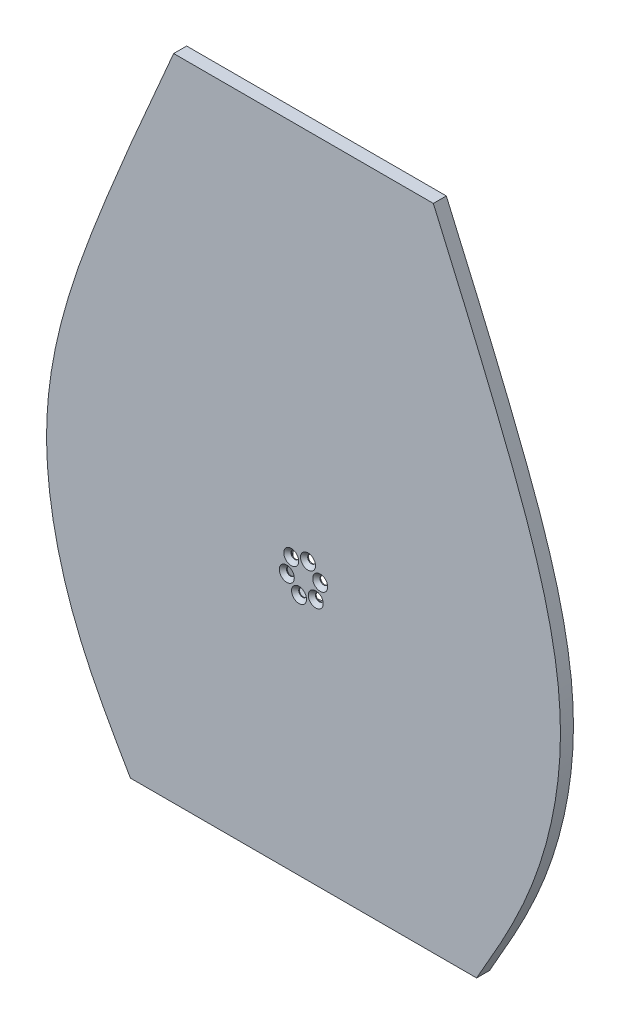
ISO-10303-21;
HEADER;
FILE_DESCRIPTION(('STEP AP214'),'2;1');
FILE_NAME('part.step','',(''),(''),'','','');
FILE_SCHEMA(('AUTOMOTIVE_DESIGN { 1 0 10303 214 1 1 1 1 }'));
ENDSEC;
DATA;
#1=APPLICATION_CONTEXT('core data for automotive mechanical design processes');
#2=APPLICATION_PROTOCOL_DEFINITION('international standard','automotive_design',2000,#1);
#3=PRODUCT_CONTEXT('',#1,'mechanical');
#4=PRODUCT('Part','Part','',(#3));
#5=PRODUCT_RELATED_PRODUCT_CATEGORY('part','',(#4));
#6=PRODUCT_DEFINITION_FORMATION('','',#4);
#7=PRODUCT_DEFINITION_CONTEXT('part definition',#1,'design');
#8=PRODUCT_DEFINITION('design','',#6,#7);
#9=PRODUCT_DEFINITION_SHAPE('','',#8);
#10=(LENGTH_UNIT() NAMED_UNIT(*) SI_UNIT(.MILLI.,.METRE.));
#11=(NAMED_UNIT(*) PLANE_ANGLE_UNIT() SI_UNIT($,.RADIAN.));
#12=(NAMED_UNIT(*) SI_UNIT($,.STERADIAN.) SOLID_ANGLE_UNIT());
#13=UNCERTAINTY_MEASURE_WITH_UNIT(LENGTH_MEASURE(1.E-05),#10,'distance_accuracy_value','');
#14=(GEOMETRIC_REPRESENTATION_CONTEXT(3) GLOBAL_UNCERTAINTY_ASSIGNED_CONTEXT((#13)) GLOBAL_UNIT_ASSIGNED_CONTEXT((#10,
#11,#12)) REPRESENTATION_CONTEXT('',''));
#15=CARTESIAN_POINT('',(0.,0.,0.));
#16=DIRECTION('',(0.,0.,1.));
#17=DIRECTION('',(1.,0.,0.));
#18=AXIS2_PLACEMENT_3D('',#15,#16,#17);
#19=CARTESIAN_POINT('',(200.,-300.,15.));
#20=CARTESIAN_POINT('',(220.438440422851,-264.664756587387,15.));
#21=CARTESIAN_POINT('',(273.637563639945,-172.69081291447,15.));
#22=CARTESIAN_POINT('',(317.637202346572,22.7615322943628,15.));
#23=CARTESIAN_POINT('',(241.360028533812,240.082695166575,15.));
#24=CARTESIAN_POINT('',(178.61116960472,384.260313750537,15.));
#25=CARTESIAN_POINT('',(150.,450.,15.));
#26=B_SPLINE_CURVE_WITH_KNOTS('',3,(#19,#20,#21,#22,#23,#24,#25),.UNSPECIFIED.,.F.,.F.,(4,1,1,1,
4),(0.,0.154462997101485,0.402051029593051,0.727357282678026,1.),.UNSPECIFIED.);
#27=DIRECTION('',(0.,0.,-1.));
#28=VECTOR('',#27,1.);
#29=SURFACE_OF_LINEAR_EXTRUSION('',#26,#28);
#30=CARTESIAN_POINT('',(200.,-300.,0.));
#31=CARTESIAN_POINT('',(220.438440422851,-264.664756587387,0.));
#32=CARTESIAN_POINT('',(273.637563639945,-172.69081291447,0.));
#33=CARTESIAN_POINT('',(317.637202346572,22.7615322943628,0.));
#34=CARTESIAN_POINT('',(241.360028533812,240.082695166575,0.));
#35=CARTESIAN_POINT('',(178.61116960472,384.260313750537,0.));
#36=CARTESIAN_POINT('',(150.,450.,0.));
#37=B_SPLINE_CURVE_WITH_KNOTS('',3,(#30,#31,#32,#33,#34,#35,#36),.UNSPECIFIED.,.F.,.F.,(4,1,1,1,
4),(0.,0.154462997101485,0.402051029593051,0.727357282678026,1.),.UNSPECIFIED.);
#38=CARTESIAN_POINT('',(200.,-300.,0.));
#39=VERTEX_POINT('',#38);
#40=CARTESIAN_POINT('',(150.,450.,0.));
#41=VERTEX_POINT('',#40);
#42=EDGE_CURVE('E79',#39,#41,#37,.T.);
#43=ORIENTED_EDGE('',*,*,#42,.T.);
#44=DIRECTION('',(0.,0.,-1.));
#45=VECTOR('',#44,1.);
#46=CARTESIAN_POINT('',(150.,450.,15.));
#47=LINE('',#46,#45);
#48=CARTESIAN_POINT('',(150.,450.,15.));
#49=VERTEX_POINT('',#48);
#50=EDGE_CURVE('E11',#49,#41,#47,.T.);
#51=ORIENTED_EDGE('',*,*,#50,.F.);
#52=CARTESIAN_POINT('',(200.,-300.,15.));
#53=VERTEX_POINT('',#52);
#54=EDGE_CURVE('E111',#53,#49,#26,.T.);
#55=ORIENTED_EDGE('',*,*,#54,.F.);
#56=DIRECTION('',(0.,0.,-1.));
#57=VECTOR('',#56,1.);
#58=CARTESIAN_POINT('',(200.,-300.,15.));
#59=LINE('',#58,#57);
#60=EDGE_CURVE('E91',#53,#39,#59,.T.);
#61=ORIENTED_EDGE('',*,*,#60,.T.);
#62=EDGE_LOOP('',(#43,#51,#55,#61));
#63=FACE_BOUND('',#62,.T.);
#64=ADVANCED_FACE('F32',(#63),#29,.F.);
#65=CARTESIAN_POINT('',(-150.,450.,15.));
#66=DIRECTION('',(0.,-1.,0.));
#67=DIRECTION('',(1.,0.,0.));
#68=AXIS2_PLACEMENT_3D('',#65,#66,#67);
#69=PLANE('',#68);
#70=DIRECTION('',(-1.,0.,0.));
#71=VECTOR('',#70,1.);
#72=CARTESIAN_POINT('',(-150.,450.,0.));
#73=LINE('',#72,#71);
#74=CARTESIAN_POINT('',(-150.,450.,0.));
#75=VERTEX_POINT('',#74);
#76=EDGE_CURVE('E75',#41,#75,#73,.T.);
#77=ORIENTED_EDGE('',*,*,#76,.T.);
#78=DIRECTION('',(0.,0.,-1.));
#79=VECTOR('',#78,1.);
#80=CARTESIAN_POINT('',(-150.,450.,15.));
#81=LINE('',#80,#79);
#82=CARTESIAN_POINT('',(-150.,450.,15.));
#83=VERTEX_POINT('',#82);
#84=EDGE_CURVE('E41',#83,#75,#81,.T.);
#85=ORIENTED_EDGE('',*,*,#84,.F.);
#86=DIRECTION('',(-1.,0.,0.));
#87=VECTOR('',#86,1.);
#88=CARTESIAN_POINT('',(-150.,450.,15.));
#89=LINE('',#88,#87);
#90=EDGE_CURVE('E87',#49,#83,#89,.T.);
#91=ORIENTED_EDGE('',*,*,#90,.F.);
#92=ORIENTED_EDGE('',*,*,#50,.T.);
#93=EDGE_LOOP('',(#77,#85,#91,#92));
#94=FACE_BOUND('',#93,.T.);
#95=ADVANCED_FACE('F86',(#94),#69,.F.);
#96=CARTESIAN_POINT('',(-150.,450.,15.));
#97=CARTESIAN_POINT('',(-178.61116960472,384.260313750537,15.));
#98=CARTESIAN_POINT('',(-241.360028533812,240.082695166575,15.));
#99=CARTESIAN_POINT('',(-317.637202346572,22.7615322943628,15.));
#100=CARTESIAN_POINT('',(-273.637563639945,-172.69081291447,15.));
#101=CARTESIAN_POINT('',(-220.438440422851,-264.664756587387,15.));
#102=CARTESIAN_POINT('',(-200.,-300.,15.));
#103=B_SPLINE_CURVE_WITH_KNOTS('',3,(#96,#97,#98,#99,#100,#101,#102),.UNSPECIFIED.,.F.,.F.,(4,1,
1,1,4),(0.,0.272642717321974,0.597948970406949,0.845537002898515,1.),.UNSPECIFIED.);
#104=DIRECTION('',(0.,0.,-1.));
#105=VECTOR('',#104,1.);
#106=SURFACE_OF_LINEAR_EXTRUSION('',#103,#105);
#107=CARTESIAN_POINT('',(-150.,450.,0.));
#108=CARTESIAN_POINT('',(-178.61116960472,384.260313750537,0.));
#109=CARTESIAN_POINT('',(-241.360028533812,240.082695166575,0.));
#110=CARTESIAN_POINT('',(-317.637202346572,22.7615322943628,0.));
#111=CARTESIAN_POINT('',(-273.637563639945,-172.69081291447,0.));
#112=CARTESIAN_POINT('',(-220.438440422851,-264.664756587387,0.));
#113=CARTESIAN_POINT('',(-200.,-300.,0.));
#114=B_SPLINE_CURVE_WITH_KNOTS('',3,(#107,#108,#109,#110,#111,#112,#113),.UNSPECIFIED.,.F.,.F.,
(4,1,1,1,4),(0.,0.272642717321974,0.597948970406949,0.845537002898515,1.),.UNSPECIFIED.);
#115=CARTESIAN_POINT('',(-200.,-300.,0.));
#116=VERTEX_POINT('',#115);
#117=EDGE_CURVE('E80',#75,#116,#114,.T.);
#118=ORIENTED_EDGE('',*,*,#117,.T.);
#119=DIRECTION('',(0.,0.,-1.));
#120=VECTOR('',#119,1.);
#121=CARTESIAN_POINT('',(-200.,-300.,15.));
#122=LINE('',#121,#120);
#123=CARTESIAN_POINT('',(-200.,-300.,15.));
#124=VERTEX_POINT('',#123);
#125=EDGE_CURVE('E399',#124,#116,#122,.T.);
#126=ORIENTED_EDGE('',*,*,#125,.F.);
#127=EDGE_CURVE('E54',#83,#124,#103,.T.);
#128=ORIENTED_EDGE('',*,*,#127,.F.);
#129=ORIENTED_EDGE('',*,*,#84,.T.);
#130=EDGE_LOOP('',(#118,#126,#128,#129));
#131=FACE_BOUND('',#130,.T.);
#132=ADVANCED_FACE('F129',(#131),#106,.F.);
#133=CARTESIAN_POINT('',(-200.,-300.,15.));
#134=DIRECTION('',(0.,1.,0.));
#135=DIRECTION('',(0.,0.,1.));
#136=AXIS2_PLACEMENT_3D('',#133,#134,#135);
#137=PLANE('',#136);
#138=DIRECTION('',(1.,0.,0.));
#139=VECTOR('',#138,1.);
#140=CARTESIAN_POINT('',(-200.,-300.,0.));
#141=LINE('',#140,#139);
#142=EDGE_CURVE('E107',#116,#39,#141,.T.);
#143=ORIENTED_EDGE('',*,*,#142,.T.);
#144=ORIENTED_EDGE('',*,*,#60,.F.);
#145=DIRECTION('',(1.,0.,0.));
#146=VECTOR('',#145,1.);
#147=CARTESIAN_POINT('',(-200.,-300.,15.));
#148=LINE('',#147,#146);
#149=EDGE_CURVE('E49',#124,#53,#148,.T.);
#150=ORIENTED_EDGE('',*,*,#149,.F.);
#151=ORIENTED_EDGE('',*,*,#125,.T.);
#152=EDGE_LOOP('',(#143,#144,#150,#151));
#153=FACE_BOUND('',#152,.T.);
#154=ADVANCED_FACE('F132',(#153),#137,.F.);
#155=CARTESIAN_POINT('',(288.565231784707,77.4969761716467,15.));
#156=DIRECTION('',(0.,0.,1.));
#157=DIRECTION('',(1.,0.,0.));
#158=AXIS2_PLACEMENT_3D('',#155,#156,#157);
#159=PLANE('',#158);
#160=CARTESIAN_POINT('',(19.3185165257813,5.17638090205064,15.));
#161=DIRECTION('',(0.,0.,1.));
#162=DIRECTION('',(1.,0.,0.));
#163=AXIS2_PLACEMENT_3D('',#160,#161,#162);
#164=CIRCLE('',#163,8.65);
#165=CARTESIAN_POINT('',(27.9685165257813,5.17638090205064,15.));
#166=VERTEX_POINT('',#165);
#167=EDGE_CURVE('E327',#166,#166,#164,.T.);
#168=ORIENTED_EDGE('',*,*,#167,.F.);
#169=EDGE_LOOP('',(#168));
#170=FACE_BOUND('',#169,.T.);
#171=CARTESIAN_POINT('',(14.1421356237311,-14.1421356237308,15.));
#172=DIRECTION('',(0.,0.,1.));
#173=DIRECTION('',(1.,0.,0.));
#174=AXIS2_PLACEMENT_3D('',#171,#172,#173);
#175=CIRCLE('',#174,8.65);
#176=CARTESIAN_POINT('',(22.7921356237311,-14.1421356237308,15.));
#177=VERTEX_POINT('',#176);
#178=EDGE_CURVE('E335',#177,#177,#175,.T.);
#179=ORIENTED_EDGE('',*,*,#178,.F.);
#180=EDGE_LOOP('',(#179));
#181=FACE_BOUND('',#180,.T.);
#182=CARTESIAN_POINT('',(-5.17638090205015,-19.3185165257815,15.));
#183=DIRECTION('',(0.,0.,1.));
#184=DIRECTION('',(1.,0.,0.));
#185=AXIS2_PLACEMENT_3D('',#182,#183,#184);
#186=CIRCLE('',#185,8.65);
#187=CARTESIAN_POINT('',(3.47361909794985,-19.3185165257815,15.));
#188=VERTEX_POINT('',#187);
#189=EDGE_CURVE('E342',#188,#188,#186,.T.);
#190=ORIENTED_EDGE('',*,*,#189,.F.);
#191=EDGE_LOOP('',(#190));
#192=FACE_BOUND('',#191,.T.);
#193=CARTESIAN_POINT('',(-19.3185165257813,-5.17638090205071,15.));
#194=DIRECTION('',(0.,0.,1.));
#195=DIRECTION('',(1.,0.,0.));
#196=AXIS2_PLACEMENT_3D('',#193,#194,#195);
#197=CIRCLE('',#196,8.65);
#198=CARTESIAN_POINT('',(-10.6685165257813,-5.17638090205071,15.));
#199=VERTEX_POINT('',#198);
#200=EDGE_CURVE('E349',#199,#199,#197,.T.);
#201=ORIENTED_EDGE('',*,*,#200,.F.);
#202=EDGE_LOOP('',(#201));
#203=FACE_BOUND('',#202,.T.);
#204=CARTESIAN_POINT('',(-14.1421356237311,14.1421356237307,15.));
#205=DIRECTION('',(0.,0.,1.));
#206=DIRECTION('',(1.,0.,0.));
#207=AXIS2_PLACEMENT_3D('',#204,#205,#206);
#208=CIRCLE('',#207,8.65);
#209=CARTESIAN_POINT('',(-5.49213562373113,14.1421356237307,15.));
#210=VERTEX_POINT('',#209);
#211=EDGE_CURVE('E356',#210,#210,#208,.T.);
#212=ORIENTED_EDGE('',*,*,#211,.F.);
#213=EDGE_LOOP('',(#212));
#214=FACE_BOUND('',#213,.T.);
#215=CARTESIAN_POINT('',(5.17638090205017,19.3185165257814,15.));
#216=DIRECTION('',(0.,0.,1.));
#217=DIRECTION('',(1.,0.,0.));
#218=AXIS2_PLACEMENT_3D('',#215,#216,#217);
#219=CIRCLE('',#218,8.65);
#220=CARTESIAN_POINT('',(13.8263809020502,19.3185165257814,15.));
#221=VERTEX_POINT('',#220);
#222=EDGE_CURVE('E363',#221,#221,#219,.T.);
#223=ORIENTED_EDGE('',*,*,#222,.F.);
#224=EDGE_LOOP('',(#223));
#225=FACE_BOUND('',#224,.T.);
#226=ORIENTED_EDGE('',*,*,#54,.T.);
#227=ORIENTED_EDGE('',*,*,#90,.T.);
#228=ORIENTED_EDGE('',*,*,#127,.T.);
#229=ORIENTED_EDGE('',*,*,#149,.T.);
#230=EDGE_LOOP('',(#226,#227,#228,#229));
#231=FACE_BOUND('',#230,.T.);
#232=ADVANCED_FACE('F160',(#170,#181,#192,#203,#214,#225,#231),#159,.T.);
#233=CARTESIAN_POINT('',(288.565231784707,77.4969761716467,0.));
#234=DIRECTION('',(0.,0.,1.));
#235=DIRECTION('',(1.,0.,0.));
#236=AXIS2_PLACEMENT_3D('',#233,#234,#235);
#237=PLANE('',#236);
#238=CARTESIAN_POINT('',(0.,0.,0.));
#239=DIRECTION('',(0.,0.,-1.));
#240=DIRECTION('',(-1.,0.,0.));
#241=AXIS2_PLACEMENT_3D('',#238,#239,#240);
#242=CIRCLE('',#241,27.5);
#243=CARTESIAN_POINT('',(-27.5,0.,0.));
#244=VERTEX_POINT('',#243);
#245=EDGE_CURVE('E95',#244,#244,#242,.T.);
#246=ORIENTED_EDGE('',*,*,#245,.F.);
#247=EDGE_LOOP('',(#246));
#248=FACE_BOUND('',#247,.T.);
#249=ORIENTED_EDGE('',*,*,#42,.F.);
#250=ORIENTED_EDGE('',*,*,#142,.F.);
#251=ORIENTED_EDGE('',*,*,#117,.F.);
#252=ORIENTED_EDGE('',*,*,#76,.F.);
#253=EDGE_LOOP('',(#249,#250,#251,#252));
#254=FACE_BOUND('',#253,.T.);
#255=ADVANCED_FACE('F76',(#248,#254),#237,.F.);
#256=CARTESIAN_POINT('',(0.,0.,10.));
#257=DIRECTION('',(0.,0.,-1.));
#258=DIRECTION('',(-1.,0.,0.));
#259=AXIS2_PLACEMENT_3D('',#256,#257,#258);
#260=CYLINDRICAL_SURFACE('',#259,27.5);
#261=CARTESIAN_POINT('',(0.,0.,10.));
#262=DIRECTION('',(0.,0.,-1.));
#263=DIRECTION('',(-1.,0.,0.));
#264=AXIS2_PLACEMENT_3D('',#261,#262,#263);
#265=CIRCLE('',#264,27.5);
#266=CARTESIAN_POINT('',(-27.5,0.,10.));
#267=VERTEX_POINT('',#266);
#268=EDGE_CURVE('E92',#267,#267,#265,.T.);
#269=ORIENTED_EDGE('',*,*,#268,.F.);
#270=EDGE_LOOP('',(#269));
#271=FACE_BOUND('',#270,.T.);
#272=ORIENTED_EDGE('',*,*,#245,.T.);
#273=EDGE_LOOP('',(#272));
#274=FACE_BOUND('',#273,.T.);
#275=ADVANCED_FACE('F171',(#271,#274),#260,.F.);
#276=CARTESIAN_POINT('',(0.,0.,10.));
#277=DIRECTION('',(0.,0.,-1.));
#278=DIRECTION('',(-1.,0.,0.));
#279=AXIS2_PLACEMENT_3D('',#276,#277,#278);
#280=PLANE('',#279);
#281=CARTESIAN_POINT('',(19.3185165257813,5.17638090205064,10.));
#282=DIRECTION('',(0.,0.,-1.));
#283=DIRECTION('',(-1.,0.,0.));
#284=AXIS2_PLACEMENT_3D('',#281,#282,#283);
#285=CIRCLE('',#284,4.5);
#286=CARTESIAN_POINT('',(14.8185165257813,5.17638090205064,10.));
#287=VERTEX_POINT('',#286);
#288=EDGE_CURVE('E36',#287,#287,#285,.T.);
#289=ORIENTED_EDGE('',*,*,#288,.F.);
#290=EDGE_LOOP('',(#289));
#291=FACE_BOUND('',#290,.T.);
#292=CARTESIAN_POINT('',(14.1421356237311,-14.1421356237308,10.));
#293=DIRECTION('',(0.,0.,-1.));
#294=DIRECTION('',(-1.,0.,0.));
#295=AXIS2_PLACEMENT_3D('',#292,#293,#294);
#296=CIRCLE('',#295,4.5);
#297=CARTESIAN_POINT('',(9.64213562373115,-14.1421356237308,10.));
#298=VERTEX_POINT('',#297);
#299=EDGE_CURVE('E338',#298,#298,#296,.T.);
#300=ORIENTED_EDGE('',*,*,#299,.F.);
#301=EDGE_LOOP('',(#300));
#302=FACE_BOUND('',#301,.T.);
#303=CARTESIAN_POINT('',(-5.17638090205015,-19.3185165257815,10.));
#304=DIRECTION('',(0.,0.,-1.));
#305=DIRECTION('',(-1.,0.,0.));
#306=AXIS2_PLACEMENT_3D('',#303,#304,#305);
#307=CIRCLE('',#306,4.5);
#308=CARTESIAN_POINT('',(-9.67638090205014,-19.3185165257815,10.));
#309=VERTEX_POINT('',#308);
#310=EDGE_CURVE('E345',#309,#309,#307,.T.);
#311=ORIENTED_EDGE('',*,*,#310,.F.);
#312=EDGE_LOOP('',(#311));
#313=FACE_BOUND('',#312,.T.);
#314=CARTESIAN_POINT('',(-19.3185165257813,-5.17638090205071,10.));
#315=DIRECTION('',(0.,0.,-1.));
#316=DIRECTION('',(-1.,0.,0.));
#317=AXIS2_PLACEMENT_3D('',#314,#315,#316);
#318=CIRCLE('',#317,4.5);
#319=CARTESIAN_POINT('',(-23.8185165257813,-5.17638090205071,10.));
#320=VERTEX_POINT('',#319);
#321=EDGE_CURVE('E352',#320,#320,#318,.T.);
#322=ORIENTED_EDGE('',*,*,#321,.F.);
#323=EDGE_LOOP('',(#322));
#324=FACE_BOUND('',#323,.T.);
#325=CARTESIAN_POINT('',(-14.1421356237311,14.1421356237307,10.));
#326=DIRECTION('',(0.,0.,-1.));
#327=DIRECTION('',(-1.,0.,0.));
#328=AXIS2_PLACEMENT_3D('',#325,#326,#327);
#329=CIRCLE('',#328,4.5);
#330=CARTESIAN_POINT('',(-18.6421356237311,14.1421356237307,10.));
#331=VERTEX_POINT('',#330);
#332=EDGE_CURVE('E359',#331,#331,#329,.T.);
#333=ORIENTED_EDGE('',*,*,#332,.F.);
#334=EDGE_LOOP('',(#333));
#335=FACE_BOUND('',#334,.T.);
#336=CARTESIAN_POINT('',(5.17638090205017,19.3185165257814,10.));
#337=DIRECTION('',(0.,0.,-1.));
#338=DIRECTION('',(-1.,0.,0.));
#339=AXIS2_PLACEMENT_3D('',#336,#337,#338);
#340=CIRCLE('',#339,4.5);
#341=CARTESIAN_POINT('',(0.676380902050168,19.3185165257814,10.));
#342=VERTEX_POINT('',#341);
#343=EDGE_CURVE('E365',#342,#342,#340,.T.);
#344=ORIENTED_EDGE('',*,*,#343,.F.);
#345=EDGE_LOOP('',(#344));
#346=FACE_BOUND('',#345,.T.);
#347=ORIENTED_EDGE('',*,*,#268,.T.);
#348=EDGE_LOOP('',(#347));
#349=FACE_BOUND('',#348,.T.);
#350=ADVANCED_FACE('F181',(#291,#302,#313,#324,#335,#346,#349),#280,.T.);
#351=CARTESIAN_POINT('',(5.17638090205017,19.3185165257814,15.));
#352=DIRECTION('',(0.,0.,1.));
#353=DIRECTION('',(1.,0.,0.));
#354=AXIS2_PLACEMENT_3D('',#351,#352,#353);
#355=CONICAL_SURFACE('',#354,8.65,0.785398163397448);
#356=CARTESIAN_POINT('',(5.17638090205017,19.3185165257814,10.85));
#357=DIRECTION('',(0.,0.,1.));
#358=DIRECTION('',(1.,0.,0.));
#359=AXIS2_PLACEMENT_3D('',#356,#357,#358);
#360=CIRCLE('',#359,4.5);
#361=CARTESIAN_POINT('',(9.67638090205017,19.3185165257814,10.85));
#362=VERTEX_POINT('',#361);
#363=EDGE_CURVE('E360',#362,#362,#360,.T.);
#364=ORIENTED_EDGE('',*,*,#363,.F.);
#365=EDGE_LOOP('',(#364));
#366=FACE_BOUND('',#365,.T.);
#367=ORIENTED_EDGE('',*,*,#222,.T.);
#368=EDGE_LOOP('',(#367));
#369=FACE_BOUND('',#368,.T.);
#370=ADVANCED_FACE('F197',(#366,#369),#355,.F.);
#371=CARTESIAN_POINT('',(5.17638090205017,19.3185165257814,15.));
#372=DIRECTION('',(0.,0.,1.));
#373=DIRECTION('',(1.,0.,0.));
#374=AXIS2_PLACEMENT_3D('',#371,#372,#373);
#375=CYLINDRICAL_SURFACE('',#374,4.5);
#376=ORIENTED_EDGE('',*,*,#343,.T.);
#377=EDGE_LOOP('',(#376));
#378=FACE_BOUND('',#377,.T.);
#379=ORIENTED_EDGE('',*,*,#363,.T.);
#380=EDGE_LOOP('',(#379));
#381=FACE_BOUND('',#380,.T.);
#382=ADVANCED_FACE('F207',(#378,#381),#375,.F.);
#383=CARTESIAN_POINT('',(-14.1421356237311,14.1421356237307,15.));
#384=DIRECTION('',(0.,0.,1.));
#385=DIRECTION('',(1.,0.,0.));
#386=AXIS2_PLACEMENT_3D('',#383,#384,#385);
#387=CONICAL_SURFACE('',#386,8.65,0.785398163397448);
#388=CARTESIAN_POINT('',(-14.1421356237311,14.1421356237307,10.85));
#389=DIRECTION('',(0.,0.,1.));
#390=DIRECTION('',(1.,0.,0.));
#391=AXIS2_PLACEMENT_3D('',#388,#389,#390);
#392=CIRCLE('',#391,4.5);
#393=CARTESIAN_POINT('',(-9.64213562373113,14.1421356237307,10.85));
#394=VERTEX_POINT('',#393);
#395=EDGE_CURVE('E353',#394,#394,#392,.T.);
#396=ORIENTED_EDGE('',*,*,#395,.F.);
#397=EDGE_LOOP('',(#396));
#398=FACE_BOUND('',#397,.T.);
#399=ORIENTED_EDGE('',*,*,#211,.T.);
#400=EDGE_LOOP('',(#399));
#401=FACE_BOUND('',#400,.T.);
#402=ADVANCED_FACE('F217',(#398,#401),#387,.F.);
#403=CARTESIAN_POINT('',(-14.1421356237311,14.1421356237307,15.));
#404=DIRECTION('',(0.,0.,1.));
#405=DIRECTION('',(1.,0.,0.));
#406=AXIS2_PLACEMENT_3D('',#403,#404,#405);
#407=CYLINDRICAL_SURFACE('',#406,4.5);
#408=ORIENTED_EDGE('',*,*,#332,.T.);
#409=EDGE_LOOP('',(#408));
#410=FACE_BOUND('',#409,.T.);
#411=ORIENTED_EDGE('',*,*,#395,.T.);
#412=EDGE_LOOP('',(#411));
#413=FACE_BOUND('',#412,.T.);
#414=ADVANCED_FACE('F227',(#410,#413),#407,.F.);
#415=CARTESIAN_POINT('',(-19.3185165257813,-5.17638090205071,15.));
#416=DIRECTION('',(0.,0.,1.));
#417=DIRECTION('',(1.,0.,0.));
#418=AXIS2_PLACEMENT_3D('',#415,#416,#417);
#419=CONICAL_SURFACE('',#418,8.65,0.785398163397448);
#420=CARTESIAN_POINT('',(-19.3185165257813,-5.17638090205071,10.85));
#421=DIRECTION('',(0.,0.,1.));
#422=DIRECTION('',(1.,0.,0.));
#423=AXIS2_PLACEMENT_3D('',#420,#421,#422);
#424=CIRCLE('',#423,4.5);
#425=CARTESIAN_POINT('',(-14.8185165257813,-5.17638090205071,10.85));
#426=VERTEX_POINT('',#425);
#427=EDGE_CURVE('E346',#426,#426,#424,.T.);
#428=ORIENTED_EDGE('',*,*,#427,.F.);
#429=EDGE_LOOP('',(#428));
#430=FACE_BOUND('',#429,.T.);
#431=ORIENTED_EDGE('',*,*,#200,.T.);
#432=EDGE_LOOP('',(#431));
#433=FACE_BOUND('',#432,.T.);
#434=ADVANCED_FACE('F237',(#430,#433),#419,.F.);
#435=CARTESIAN_POINT('',(-19.3185165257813,-5.17638090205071,15.));
#436=DIRECTION('',(0.,0.,1.));
#437=DIRECTION('',(1.,0.,0.));
#438=AXIS2_PLACEMENT_3D('',#435,#436,#437);
#439=CYLINDRICAL_SURFACE('',#438,4.5);
#440=ORIENTED_EDGE('',*,*,#321,.T.);
#441=EDGE_LOOP('',(#440));
#442=FACE_BOUND('',#441,.T.);
#443=ORIENTED_EDGE('',*,*,#427,.T.);
#444=EDGE_LOOP('',(#443));
#445=FACE_BOUND('',#444,.T.);
#446=ADVANCED_FACE('F247',(#442,#445),#439,.F.);
#447=CARTESIAN_POINT('',(-5.17638090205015,-19.3185165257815,15.));
#448=DIRECTION('',(0.,0.,1.));
#449=DIRECTION('',(1.,0.,0.));
#450=AXIS2_PLACEMENT_3D('',#447,#448,#449);
#451=CONICAL_SURFACE('',#450,8.65,0.785398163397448);
#452=CARTESIAN_POINT('',(-5.17638090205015,-19.3185165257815,10.85));
#453=DIRECTION('',(0.,0.,1.));
#454=DIRECTION('',(1.,0.,0.));
#455=AXIS2_PLACEMENT_3D('',#452,#453,#454);
#456=CIRCLE('',#455,4.5);
#457=CARTESIAN_POINT('',(-0.676380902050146,-19.3185165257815,10.85));
#458=VERTEX_POINT('',#457);
#459=EDGE_CURVE('E339',#458,#458,#456,.T.);
#460=ORIENTED_EDGE('',*,*,#459,.F.);
#461=EDGE_LOOP('',(#460));
#462=FACE_BOUND('',#461,.T.);
#463=ORIENTED_EDGE('',*,*,#189,.T.);
#464=EDGE_LOOP('',(#463));
#465=FACE_BOUND('',#464,.T.);
#466=ADVANCED_FACE('F257',(#462,#465),#451,.F.);
#467=CARTESIAN_POINT('',(-5.17638090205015,-19.3185165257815,15.));
#468=DIRECTION('',(0.,0.,1.));
#469=DIRECTION('',(1.,0.,0.));
#470=AXIS2_PLACEMENT_3D('',#467,#468,#469);
#471=CYLINDRICAL_SURFACE('',#470,4.5);
#472=ORIENTED_EDGE('',*,*,#310,.T.);
#473=EDGE_LOOP('',(#472));
#474=FACE_BOUND('',#473,.T.);
#475=ORIENTED_EDGE('',*,*,#459,.T.);
#476=EDGE_LOOP('',(#475));
#477=FACE_BOUND('',#476,.T.);
#478=ADVANCED_FACE('F267',(#474,#477),#471,.F.);
#479=CARTESIAN_POINT('',(14.1421356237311,-14.1421356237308,15.));
#480=DIRECTION('',(0.,0.,1.));
#481=DIRECTION('',(1.,0.,0.));
#482=AXIS2_PLACEMENT_3D('',#479,#480,#481);
#483=CONICAL_SURFACE('',#482,8.65,0.785398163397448);
#484=CARTESIAN_POINT('',(14.1421356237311,-14.1421356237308,10.85));
#485=DIRECTION('',(0.,0.,1.));
#486=DIRECTION('',(1.,0.,0.));
#487=AXIS2_PLACEMENT_3D('',#484,#485,#486);
#488=CIRCLE('',#487,4.5);
#489=CARTESIAN_POINT('',(18.6421356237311,-14.1421356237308,10.85));
#490=VERTEX_POINT('',#489);
#491=EDGE_CURVE('E332',#490,#490,#488,.T.);
#492=ORIENTED_EDGE('',*,*,#491,.F.);
#493=EDGE_LOOP('',(#492));
#494=FACE_BOUND('',#493,.T.);
#495=ORIENTED_EDGE('',*,*,#178,.T.);
#496=EDGE_LOOP('',(#495));
#497=FACE_BOUND('',#496,.T.);
#498=ADVANCED_FACE('F277',(#494,#497),#483,.F.);
#499=CARTESIAN_POINT('',(14.1421356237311,-14.1421356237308,15.));
#500=DIRECTION('',(0.,0.,1.));
#501=DIRECTION('',(1.,0.,0.));
#502=AXIS2_PLACEMENT_3D('',#499,#500,#501);
#503=CYLINDRICAL_SURFACE('',#502,4.5);
#504=ORIENTED_EDGE('',*,*,#299,.T.);
#505=EDGE_LOOP('',(#504));
#506=FACE_BOUND('',#505,.T.);
#507=ORIENTED_EDGE('',*,*,#491,.T.);
#508=EDGE_LOOP('',(#507));
#509=FACE_BOUND('',#508,.T.);
#510=ADVANCED_FACE('F287',(#506,#509),#503,.F.);
#511=CARTESIAN_POINT('',(19.3185165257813,5.17638090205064,15.));
#512=DIRECTION('',(0.,0.,1.));
#513=DIRECTION('',(1.,0.,0.));
#514=AXIS2_PLACEMENT_3D('',#511,#512,#513);
#515=CONICAL_SURFACE('',#514,8.65,0.785398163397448);
#516=CARTESIAN_POINT('',(19.3185165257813,5.17638090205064,10.85));
#517=DIRECTION('',(0.,0.,1.));
#518=DIRECTION('',(1.,0.,0.));
#519=AXIS2_PLACEMENT_3D('',#516,#517,#518);
#520=CIRCLE('',#519,4.5);
#521=CARTESIAN_POINT('',(23.8185165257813,5.17638090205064,10.85));
#522=VERTEX_POINT('',#521);
#523=EDGE_CURVE('E326',#522,#522,#520,.T.);
#524=ORIENTED_EDGE('',*,*,#523,.F.);
#525=EDGE_LOOP('',(#524));
#526=FACE_BOUND('',#525,.T.);
#527=ORIENTED_EDGE('',*,*,#167,.T.);
#528=EDGE_LOOP('',(#527));
#529=FACE_BOUND('',#528,.T.);
#530=ADVANCED_FACE('F297',(#526,#529),#515,.F.);
#531=CARTESIAN_POINT('',(19.3185165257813,5.17638090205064,15.));
#532=DIRECTION('',(0.,0.,1.));
#533=DIRECTION('',(1.,0.,0.));
#534=AXIS2_PLACEMENT_3D('',#531,#532,#533);
#535=CYLINDRICAL_SURFACE('',#534,4.5);
#536=ORIENTED_EDGE('',*,*,#288,.T.);
#537=EDGE_LOOP('',(#536));
#538=FACE_BOUND('',#537,.T.);
#539=ORIENTED_EDGE('',*,*,#523,.T.);
#540=EDGE_LOOP('',(#539));
#541=FACE_BOUND('',#540,.T.);
#542=ADVANCED_FACE('F307',(#538,#541),#535,.F.);
#543=CLOSED_SHELL('',(#64,#95,#132,#154,#232,#255,#275,#350,#370,#382,#402,#414,#434,#446,#466,
#478,#498,#510,#530,#542));
#544=MANIFOLD_SOLID_BREP('B2',#543);
#545=ADVANCED_BREP_SHAPE_REPRESENTATION('',(#18,#544),#14);
#546=SHAPE_DEFINITION_REPRESENTATION(#9,#545);
ENDSEC;
END-ISO-10303-21;
